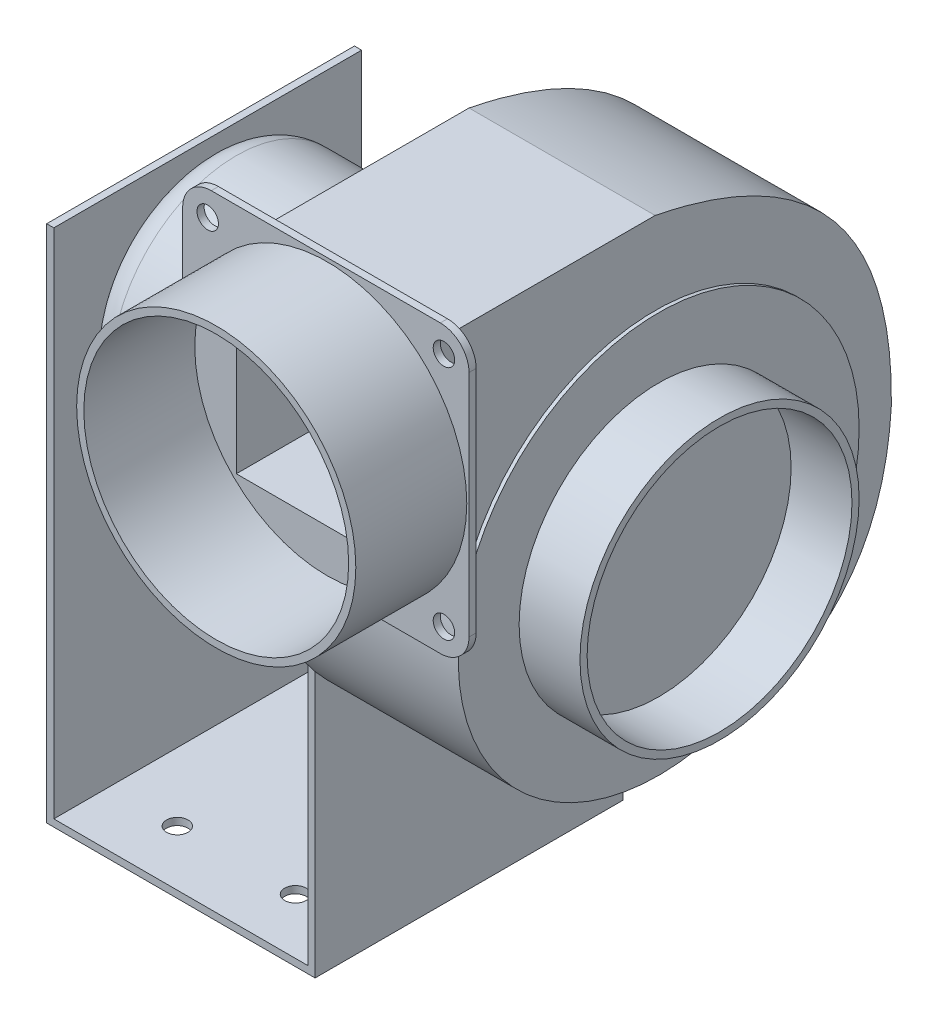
from build123d import *

# Parameters (mm, degrees)
EXTRUDE_1_DEPTH     = 52
EXTRUDE_2_DEPTH     = 2
SKETCH_3_R          = 3
CUT_EXTRUDE_1_DEPTH = 2
SKETCH_4_R          = 56
EXTRUDE_3_DEPTH     = 1
SKETCH_5_R          = 39
SKETCH_5_R_2        = 37
EXTRUDE_4_DEPTH     = 17
SKETCH_6_R          = 35
EXTRUDE_5_DEPTH     = 73
FILLET_1_R          = 8
SKETCH_7_W          = 50
SKETCH_7_H          = 50
CUT_EXTRUDE_2_DEPTH = 73
SKETCH_8_R          = 39
SKETCH_8_R_2        = 37
EXTRUDE_6_DEPTH     = 31
SKETCH_9_W          = 86
SKETCH_9_H          = 145
EXTRUDE_7_DEPTH     = 2
SKETCH_11_W         = 86
SKETCH_11_H         = 2
EXTRUDE_8_DEPTH     = 73
SKETCH_18_R         = 3
CUT_EXTRUDE_3_DEPTH = 2
SKETCH_22_W         = 2
SKETCH_22_H         = 86
EXTRUDE_9_DEPTH     = 143


with BuildPart() as part:
    # Sketch 1 → Extrude 1 (new body)
    with BuildSketch(Plane(origin=(0, 0, 0), x_dir=(0, 0, -1), z_dir=(1, 0, 0))):
        with BuildLine():
            Line((0, 79), (-64, 79))
            Line((-64, 79), (-64, 19))
            Line((-64, 19), (-52.678268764, 19))
            ThreePointArc((-52.678268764, 19), (-45.82575695, -32.186953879), (0, -56))
            add(Edge.make_bspline(
                [(0, -56), (62.614704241, -57.837375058), (66, 0)],
                knots=[0, 0, 0, 1, 1, 1], degree=2))
            add(Edge.make_bspline(
                [(0, 79), (66.927644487, 65.8023555), (66, 0)],
                knots=[0, 0, 0, 1, 1, 1], degree=2))
        make_face()
    extrude(amount=EXTRUDE_1_DEPTH)

    # Sketch 2 → Extrude 2 (add)
    with BuildSketch(Plane.XY.offset(64)):
        with BuildLine():
            Line((-6, 9), (58, 9))
            ThreePointArc((58, 9), (63.656854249, 11.343145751), (66, 17))
            Line((66, 17), (66, 81))
            ThreePointArc((66, 81), (63.656854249, 86.656854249), (58, 89))
            Line((58, 89), (-6, 89))
            ThreePointArc((-6, 89), (-11.656854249, 86.656854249), (-14, 81))
            Line((-14, 81), (-14, 17))
            ThreePointArc((-14, 17), (-11.656854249, 11.343145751), (-6, 9))
        make_face()
    extrude(amount=EXTRUDE_2_DEPTH)

    # Sketch 3 → Cut-Extrude 1 (cut)
    with BuildSketch(Plane.XY.offset(66)):
        with Locations((-7, 82)):
            Circle(SKETCH_3_R)
        with Locations((59, 82)):
            Circle(SKETCH_3_R)
        with Locations((59, 16)):
            Circle(SKETCH_3_R)
        with Locations((-7, 16)):
            Circle(SKETCH_3_R)
    extrude(amount=-CUT_EXTRUDE_1_DEPTH, mode=Mode.SUBTRACT)



with BuildPart() as body_2:
    # Sketch 4 → Extrude 3 (new body)
    with BuildSketch(Plane(origin=(52, 0, 0), x_dir=(0, 0, -1), z_dir=(1, 0, 0))):
        Circle(SKETCH_4_R)
    extrude(amount=EXTRUDE_3_DEPTH)


with BuildPart() as part_1:
    add(part.part)

    add(body_2.part)  # Extrude 4 merges body 2
    # Sketch 5 → Extrude 4 (add)
    with BuildSketch(Plane(origin=(53, 0, 0), x_dir=(0, 0, -1), z_dir=(1, 0, 0))):
        Circle(SKETCH_5_R)
        Circle(SKETCH_5_R_2, mode=Mode.SUBTRACT)
    extrude(amount=EXTRUDE_4_DEPTH)

    # Sketch 6 → Extrude 5 (add)
    with BuildSketch(Plane.ZY):
        with Locations(Location((0, 0, 0), (0, 0, 180))):
            Circle(SKETCH_6_R)
    extrude(amount=EXTRUDE_5_DEPTH)

    # Fillet 1
    fillet_1_edges = [part_1.edges().sort_by_distance(p)[0] for p in [
        (-73, 0, 35),
    ]]
    fillet(fillet_1_edges, radius=FILLET_1_R)

    # Sketch 7 → Cut-Extrude 2 (cut)
    with BuildSketch(Plane.XY.offset(66)):
        with Locations((26, 49)):
            Rectangle(SKETCH_7_W, SKETCH_7_H)
    extrude(amount=-CUT_EXTRUDE_2_DEPTH, mode=Mode.SUBTRACT)

    # Sketch 8 → Extrude 6 (add)
    with BuildSketch(Plane.XY.offset(66)):
        with Locations(Location((26.382025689, 49, 0), (0, 0, 180))):
            Circle(SKETCH_8_R)
        with Locations((26.382025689, 49)):
            Circle(SKETCH_8_R_2, mode=Mode.SUBTRACT)
    extrude(amount=EXTRUDE_6_DEPTH)



with BuildPart() as body_2_2:
    # Sketch 9 → Extrude 7 (new body)
    with BuildSketch(Plane.ZY.offset(73)):
        with Locations((0, -37.5)):
            Rectangle(SKETCH_9_W, SKETCH_9_H)
    extrude(amount=EXTRUDE_7_DEPTH)

    # Sketch 11 → Extrude 8 (add)
    with BuildSketch(Plane(origin=(-73, 0, 0), x_dir=(0, 0, -1), z_dir=(1, 0, 0))):
        with Locations((0, -109)):
            Rectangle(SKETCH_11_W, SKETCH_11_H)
    extrude(amount=EXTRUDE_8_DEPTH)

    # Sketch 18 → Cut-Extrude 3 (cut)
    with BuildSketch(Plane.XZ.offset(110)):
        with Locations(Location((-54, 27.5, 0), (0, 0, 270))):
            Circle(SKETCH_18_R)
        with Locations(Location((-21, 27.5, 0), (0, 0, 270))):
            Circle(SKETCH_18_R)
        with Locations(Location((-21, -27.5, 0), (0, 0, 270))):
            Circle(SKETCH_18_R)
        with Locations(Location((-54, -27.5, 0), (0, 0, 270))):
            Circle(SKETCH_18_R)
    extrude(amount=-CUT_EXTRUDE_3_DEPTH, mode=Mode.SUBTRACT)


with BuildPart() as part_2:
    add(part_1.part)

    add(body_2_2.part)  # Extrude 9 merges body 2 2
    # Sketch 22 → Extrude 9 (add)
    with BuildSketch(Plane(origin=(0, -108, 0), x_dir=(1, 0, 0), z_dir=(0, 1, 0))):
        with Locations((-1, 0)):
            Rectangle(SKETCH_22_W, SKETCH_22_H)
    extrude(amount=EXTRUDE_9_DEPTH)


solid = part_2.part
